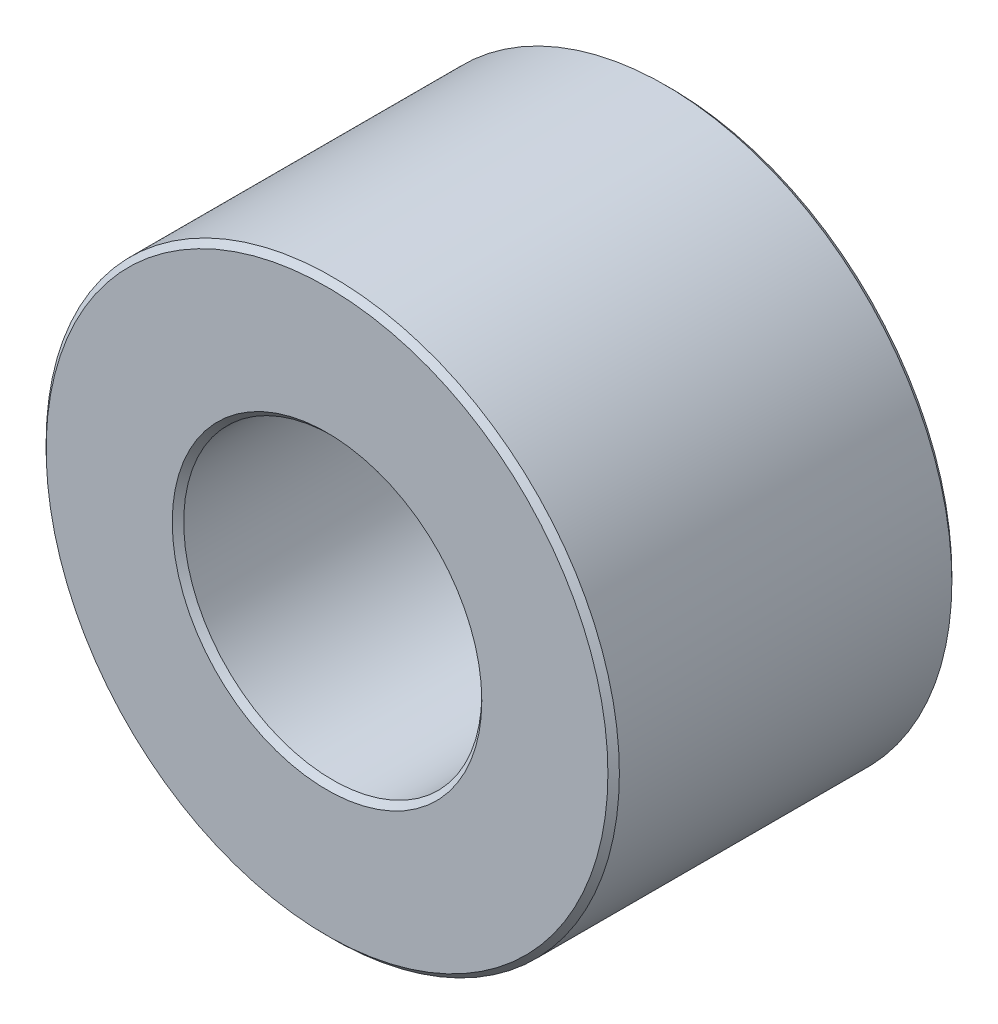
from build123d import *

# Parameters (mm, degrees)
SKETCH1_R           = 5
SKETCH1_R_2         = 2.6
BOSS_EXTRUDE2_DEPTH = 3
CHAMFER3_SIZE       = 0.1


with BuildPart() as part:
    # Sketch1 → Boss-Extrude2 (new, symmetric)
    with BuildSketch(Plane.XY):
        Circle(SKETCH1_R)
        Circle(SKETCH1_R_2, mode=Mode.SUBTRACT)
    extrude(amount=BOSS_EXTRUDE2_DEPTH, both=True)

    # Chamfer3
    chamfer3_edges = [part.edges().sort_by_distance(p)[0] for p in [
        (-5, 0, -3),
        (-5, 0, 3),
        (-2.6, 0, -3),
        (-2.6, 0, 3),
    ]]
    chamfer(chamfer3_edges, length=CHAMFER3_SIZE)


solid = part.part
